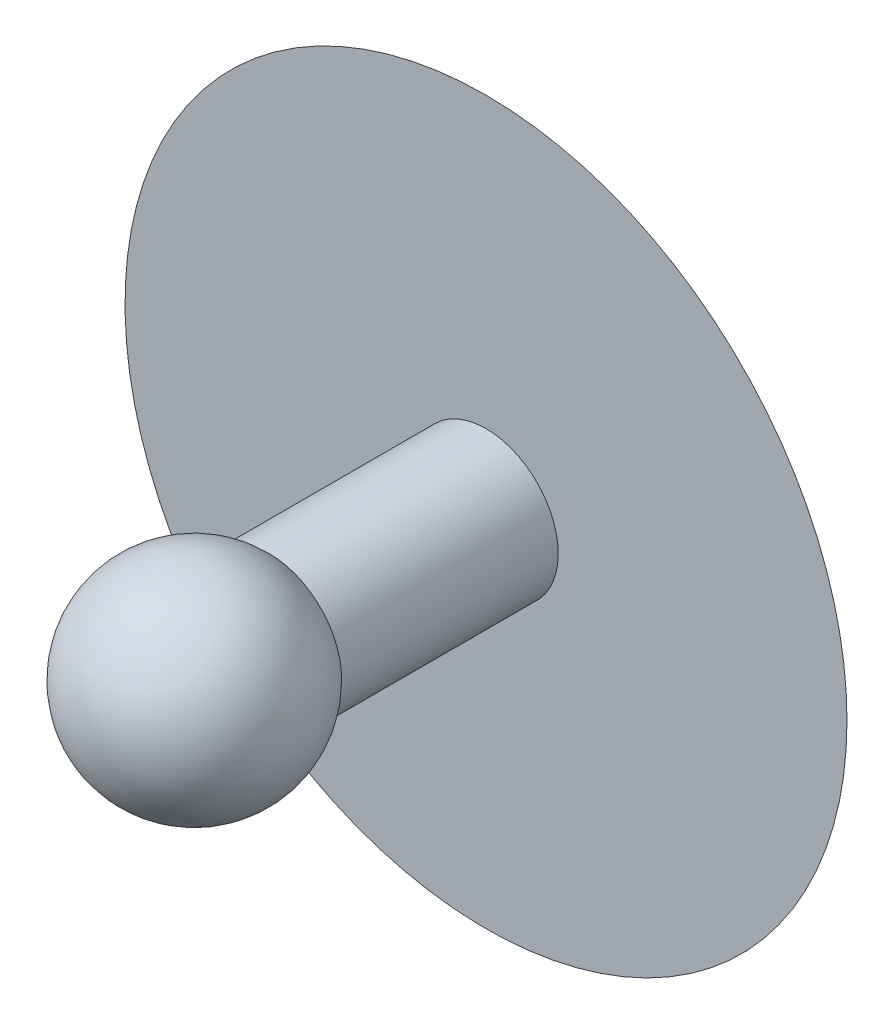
from build123d import *


with BuildPart() as part:
    # Esquisse1 → R_volution1 (revolve)
    with BuildSketch(Plane(origin=(0, 0, 0), x_dir=(0, 0, -1), z_dir=(1, 0, 0))):
        with BuildLine():
            Line((-1.5, 0.5), (0, 0.5))
            Line((0, 0.5), (0, 2.5))
            ThreePointArc((0, 2.5), (0.112466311, 1.252247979), (0.15, 0))
            Line((0.15, 0), (-1.5, 0))
            Line((-1.5, 0), (-2.742193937, 0))
            ThreePointArc((-2.742193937, 0), (-2.289960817, 0.669523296), (-1.5, 0.5))
        make_face()
    revolve(axis=Axis((0, 0, 3.675369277), (0, 0, -1)))


solid = part.part
